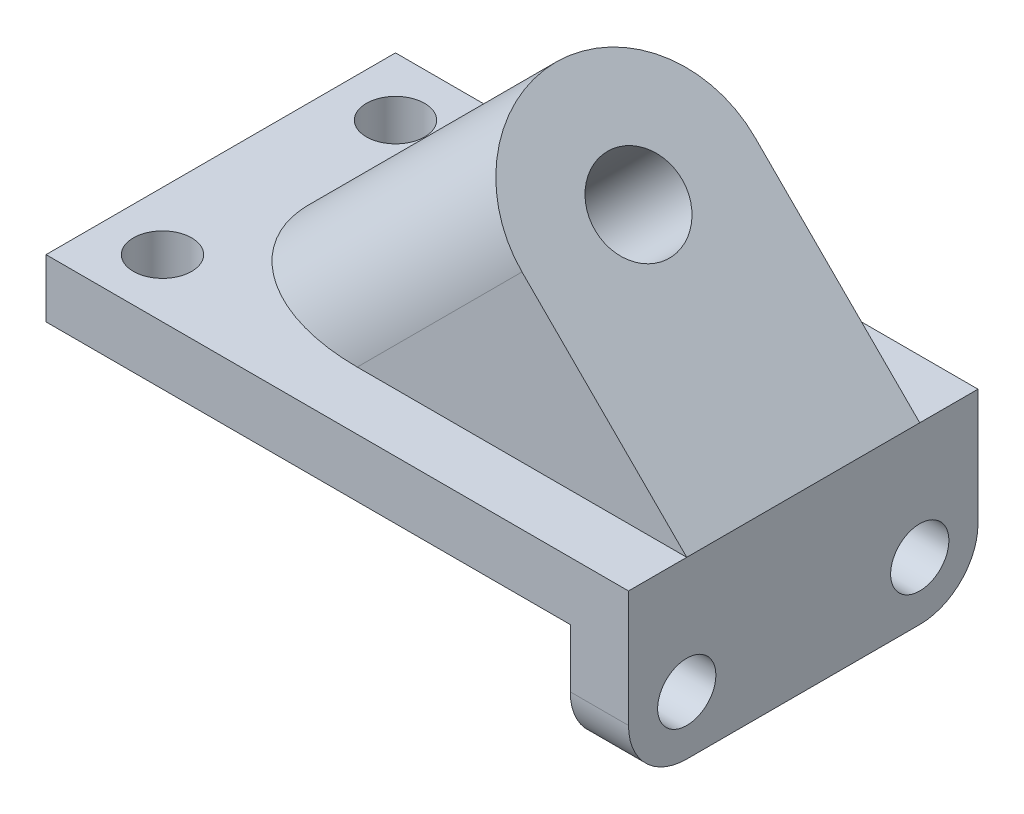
from build123d import *

# Parameters (mm, degrees)
SKETCH1_W           = 127
SKETCH1_H           = 76.2
SKETCH1_R           = 6.35
BOSS_EXTRUDE1_DEPTH = 12.7
SKETCH7_R           = 6.35
BOSS_EXTRUDE5_DEPTH = 12.7
BOSS_EXTRUDE9_REACH = 143.99
SKETCH13_R          = 9.525
CUT_EXTRUDE1_DEPTH  = 101.6


with BuildPart() as part:
    # Sketch1 → Boss-Extrude1 (new body)
    with BuildSketch(Plane(origin=(0, 0, 0), x_dir=(1, 0, 0), z_dir=(0, 1, 0))):
        with Locations((63.5, 38.1)):
            Rectangle(SKETCH1_W, SKETCH1_H)
        with Locations(Location((12.7, 12.7, 0), (0, 0, 270))):
            Circle(SKETCH1_R, mode=Mode.SUBTRACT)
        with Locations(Location((12.7, 63.5, 0), (0, 0, 270))):
            Circle(SKETCH1_R, mode=Mode.SUBTRACT)
    extrude(amount=-BOSS_EXTRUDE1_DEPTH)

    # Sketch7 → Boss-Extrude5 (add)
    with BuildSketch(Plane(origin=(127, 0, 0), x_dir=(0, 0, -1), z_dir=(1, 0, 0))):
        with BuildLine():
            Line((0, 0), (76.2, 0))
            Line((76.2, 0), (76.2, -25.4))
            ThreePointArc((76.2, -25.4), (72.480256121, -34.380256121), (63.5, -38.1))
            Line((63.5, -38.1), (12.7, -38.1))
            ThreePointArc((12.7, -38.1), (3.719743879, -34.380256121), (0, -25.4))
            Line((0, -25.4), (0, 0))
        make_face()
        with Locations((12.7, -25.4)):
            Circle(SKETCH7_R, mode=Mode.SUBTRACT)
        with Locations((63.5, -25.4)):
            Circle(SKETCH7_R, mode=Mode.SUBTRACT)
    extrude(amount=-BOSS_EXTRUDE5_DEPTH)

    # Boss-Extrude9: up to this face of the body (flat: up to its plane)
    boss_extrude9_end = Plane(part.part.faces().sort_by_distance((64.865694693, 0, -38.1))[0])
    # Sketch9 → Boss-Extrude9 (add, up to the picked face)
    with BuildSketch(Plane(origin=(63.5, 63.5, 0), x_dir=(0, 0, -1), z_dir=(0.7071067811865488, 0.7071067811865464, 0)), mode=Mode.PRIVATE) as boss_extrude9_sk1:
        with BuildLine():
            Line((12.7, -89.802561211), (63.5, -89.802561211))
            Line((63.5, -89.802561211), (63.5, -39.002561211))
            ThreePointArc((63.5, -39.002561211), (38.1, -13.602561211), (12.7, -39.002561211))
            Line((12.7, -39.002561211), (12.7, -89.802561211))
        make_face()
    boss_extrude9_tool1 = split(extrude(boss_extrude9_sk1.sketch, amount=-BOSS_EXTRUDE9_REACH, mode=Mode.PRIVATE), bisect_by=boss_extrude9_end, keep=Keep.BOTH, mode=Mode.PRIVATE)
    add(boss_extrude9_tool1.solids().sort_by(Axis((101.825801, 25.174199, -38.1), (-0.7071067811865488, -0.7071067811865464, 0)))[0])

    # Sketch13 → Cut-Extrude1 (cut)
    with BuildSketch(Plane(origin=(63.5, 63.5, 0), x_dir=(0, 0, -1), z_dir=(0.7071067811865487, 0.7071067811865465, 0))):
        with Locations(Location((38.1, -39.002561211, 0), (0, 0, 90))):
            Circle(SKETCH13_R)
    extrude(amount=-CUT_EXTRUDE1_DEPTH, mode=Mode.SUBTRACT)


solid = part.part
